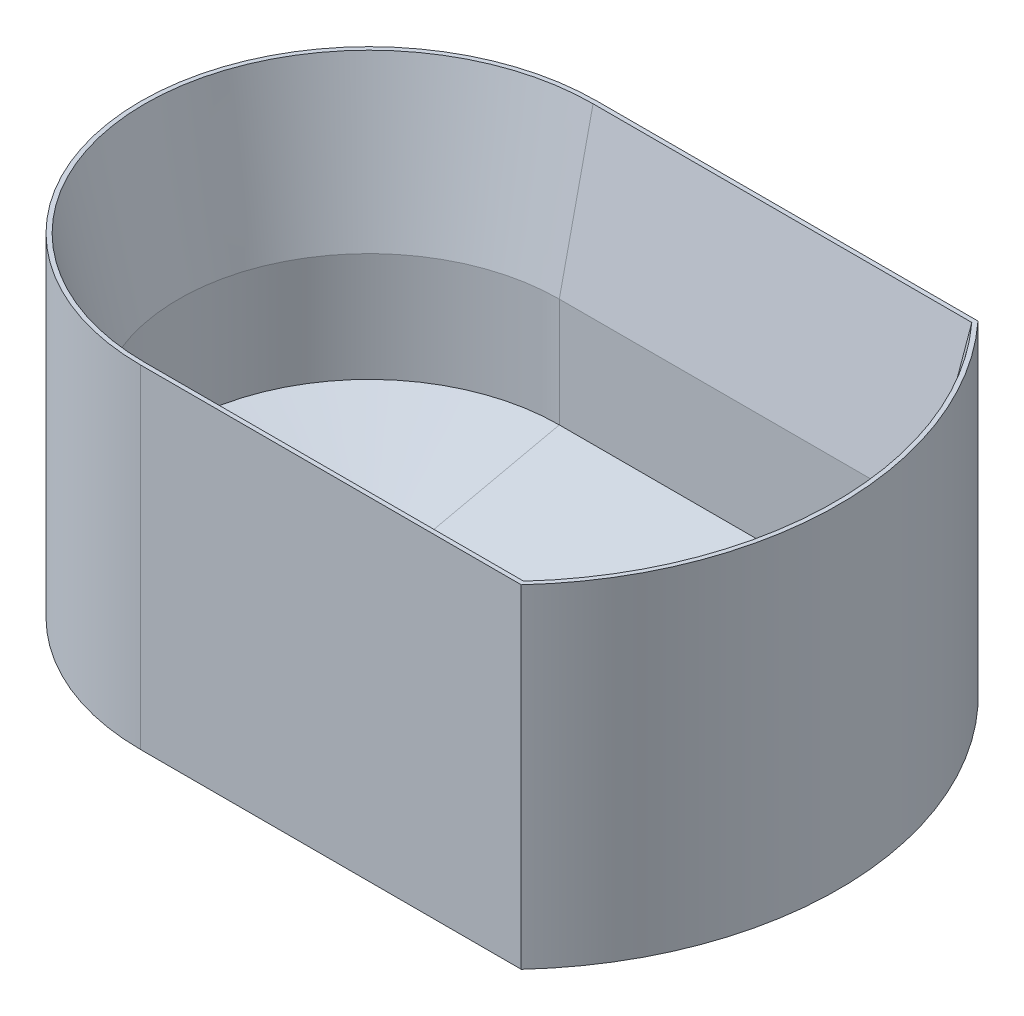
ISO-10303-21;
HEADER;
FILE_DESCRIPTION(('STEP AP214'),'2;1');
FILE_NAME('part.step','',(''),(''),'','','');
FILE_SCHEMA(('AUTOMOTIVE_DESIGN { 1 0 10303 214 1 1 1 1 }'));
ENDSEC;
DATA;
#1=APPLICATION_CONTEXT('core data for automotive mechanical design processes');
#2=APPLICATION_PROTOCOL_DEFINITION('international standard','automotive_design',2000,#1);
#3=PRODUCT_CONTEXT('',#1,'mechanical');
#4=PRODUCT('Part','Part','',(#3));
#5=PRODUCT_RELATED_PRODUCT_CATEGORY('part','',(#4));
#6=PRODUCT_DEFINITION_FORMATION('','',#4);
#7=PRODUCT_DEFINITION_CONTEXT('part definition',#1,'design');
#8=PRODUCT_DEFINITION('design','',#6,#7);
#9=PRODUCT_DEFINITION_SHAPE('','',#8);
#10=(LENGTH_UNIT() NAMED_UNIT(*) SI_UNIT(.MILLI.,.METRE.));
#11=(NAMED_UNIT(*) PLANE_ANGLE_UNIT() SI_UNIT($,.RADIAN.));
#12=(NAMED_UNIT(*) SI_UNIT($,.STERADIAN.) SOLID_ANGLE_UNIT());
#13=UNCERTAINTY_MEASURE_WITH_UNIT(LENGTH_MEASURE(1.E-05),#10,'distance_accuracy_value','');
#14=(GEOMETRIC_REPRESENTATION_CONTEXT(3) GLOBAL_UNCERTAINTY_ASSIGNED_CONTEXT((#13)) GLOBAL_UNIT_ASSIGNED_CONTEXT((#10,
#11,#12)) REPRESENTATION_CONTEXT('',''));
#15=CARTESIAN_POINT('',(0.,0.,0.));
#16=DIRECTION('',(0.,0.,1.));
#17=DIRECTION('',(1.,0.,0.));
#18=AXIS2_PLACEMENT_3D('',#15,#16,#17);
#19=CARTESIAN_POINT('',(0.,44.45,-30.48));
#20=DIRECTION('',(0.,-1.,0.));
#21=DIRECTION('',(0.,0.,-1.));
#22=AXIS2_PLACEMENT_3D('',#19,#20,#21);
#23=CYLINDRICAL_SURFACE('',#22,30.48);
#24=CARTESIAN_POINT('',(0.,0.,-30.48));
#25=DIRECTION('',(0.,1.,0.));
#26=DIRECTION('',(0.,0.,1.));
#27=AXIS2_PLACEMENT_3D('',#24,#25,#26);
#28=CIRCLE('',#27,30.48);
#29=CARTESIAN_POINT('',(0.,0.,-60.96));
#30=VERTEX_POINT('',#29);
#31=CARTESIAN_POINT('',(0.,0.,0.));
#32=VERTEX_POINT('',#31);
#33=EDGE_CURVE('E149',#30,#32,#28,.T.);
#34=ORIENTED_EDGE('',*,*,#33,.T.);
#35=DIRECTION('',(0.,-1.,0.));
#36=VECTOR('',#35,1.);
#37=CARTESIAN_POINT('',(0.,44.45,0.));
#38=LINE('',#37,#36);
#39=CARTESIAN_POINT('',(0.,44.45,0.));
#40=VERTEX_POINT('',#39);
#41=EDGE_CURVE('E131',#40,#32,#38,.T.);
#42=ORIENTED_EDGE('',*,*,#41,.F.);
#43=CARTESIAN_POINT('',(0.,44.45,-30.48));
#44=DIRECTION('',(0.,1.,0.));
#45=DIRECTION('',(0.,0.,1.));
#46=AXIS2_PLACEMENT_3D('',#43,#44,#45);
#47=CIRCLE('',#46,30.48);
#48=CARTESIAN_POINT('',(0.,44.45,-60.96));
#49=VERTEX_POINT('',#48);
#50=EDGE_CURVE('E138',#49,#40,#47,.T.);
#51=ORIENTED_EDGE('',*,*,#50,.F.);
#52=DIRECTION('',(0.,-1.,0.));
#53=VECTOR('',#52,1.);
#54=CARTESIAN_POINT('',(0.,44.45,-60.96));
#55=LINE('',#54,#53);
#56=EDGE_CURVE('E272',#49,#30,#55,.T.);
#57=ORIENTED_EDGE('',*,*,#56,.T.);
#58=EDGE_LOOP('',(#34,#42,#51,#57));
#59=FACE_BOUND('',#58,.T.);
#60=ADVANCED_FACE('F35',(#59),#23,.T.);
#61=CARTESIAN_POINT('',(0.,44.45,0.));
#62=DIRECTION('',(0.,0.,-1.));
#63=DIRECTION('',(-1.,0.,0.));
#64=AXIS2_PLACEMENT_3D('',#61,#62,#63);
#65=PLANE('',#64);
#66=DIRECTION('',(1.,0.,0.));
#67=VECTOR('',#66,1.);
#68=CARTESIAN_POINT('',(0.,0.,0.));
#69=LINE('',#68,#67);
#70=CARTESIAN_POINT('',(50.8,0.,0.));
#71=VERTEX_POINT('',#70);
#72=EDGE_CURVE('E274',#32,#71,#69,.T.);
#73=ORIENTED_EDGE('',*,*,#72,.T.);
#74=DIRECTION('',(0.,-1.,0.));
#75=VECTOR('',#74,1.);
#76=CARTESIAN_POINT('',(50.8,44.45,0.));
#77=LINE('',#76,#75);
#78=CARTESIAN_POINT('',(50.8,44.45,0.));
#79=VERTEX_POINT('',#78);
#80=EDGE_CURVE('E133',#79,#71,#77,.T.);
#81=ORIENTED_EDGE('',*,*,#80,.F.);
#82=DIRECTION('',(1.,0.,0.));
#83=VECTOR('',#82,1.);
#84=CARTESIAN_POINT('',(0.,44.45,0.));
#85=LINE('',#84,#83);
#86=EDGE_CURVE('E126',#40,#79,#85,.T.);
#87=ORIENTED_EDGE('',*,*,#86,.F.);
#88=ORIENTED_EDGE('',*,*,#41,.T.);
#89=EDGE_LOOP('',(#73,#81,#87,#88));
#90=FACE_BOUND('',#89,.T.);
#91=ADVANCED_FACE('F129',(#90),#65,.F.);
#92=CARTESIAN_POINT('',(17.8288823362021,44.45,-30.48));
#93=DIRECTION('',(0.,-1.,0.));
#94=DIRECTION('',(0.,0.,-1.));
#95=AXIS2_PLACEMENT_3D('',#92,#93,#94);
#96=CYLINDRICAL_SURFACE('',#95,44.9012806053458);
#97=CARTESIAN_POINT('',(17.8288823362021,0.,-30.48));
#98=DIRECTION('',(0.,1.,0.));
#99=DIRECTION('',(0.,0.,1.));
#100=AXIS2_PLACEMENT_3D('',#97,#98,#99);
#101=CIRCLE('',#100,44.9012806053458);
#102=CARTESIAN_POINT('',(50.8,0.,-60.96));
#103=VERTEX_POINT('',#102);
#104=EDGE_CURVE('E276',#103,#71,#101,.F.);
#105=ORIENTED_EDGE('',*,*,#104,.F.);
#106=DIRECTION('',(0.,-1.,0.));
#107=VECTOR('',#106,1.);
#108=CARTESIAN_POINT('',(50.8,44.45,-60.96));
#109=LINE('',#108,#107);
#110=CARTESIAN_POINT('',(50.8,44.45,-60.96));
#111=VERTEX_POINT('',#110);
#112=EDGE_CURVE('E154',#111,#103,#109,.T.);
#113=ORIENTED_EDGE('',*,*,#112,.F.);
#114=CARTESIAN_POINT('',(17.8288823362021,44.45,-30.48));
#115=DIRECTION('',(0.,1.,0.));
#116=DIRECTION('',(0.,0.,1.));
#117=AXIS2_PLACEMENT_3D('',#114,#115,#116);
#118=CIRCLE('',#117,44.9012806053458);
#119=EDGE_CURVE('E137',#111,#79,#118,.F.);
#120=ORIENTED_EDGE('',*,*,#119,.T.);
#121=ORIENTED_EDGE('',*,*,#80,.T.);
#122=EDGE_LOOP('',(#105,#113,#120,#121));
#123=FACE_BOUND('',#122,.T.);
#124=ADVANCED_FACE('F286',(#123),#96,.T.);
#125=CARTESIAN_POINT('',(0.,44.45,-60.96));
#126=DIRECTION('',(0.,0.,-1.));
#127=DIRECTION('',(-1.,0.,0.));
#128=AXIS2_PLACEMENT_3D('',#125,#126,#127);
#129=PLANE('',#128);
#130=DIRECTION('',(1.,0.,0.));
#131=VECTOR('',#130,1.);
#132=CARTESIAN_POINT('',(0.,0.,-60.96));
#133=LINE('',#132,#131);
#134=EDGE_CURVE('E146',#30,#103,#133,.T.);
#135=ORIENTED_EDGE('',*,*,#134,.F.);
#136=ORIENTED_EDGE('',*,*,#56,.F.);
#137=DIRECTION('',(1.,0.,0.));
#138=VECTOR('',#137,1.);
#139=CARTESIAN_POINT('',(0.,44.45,-60.96));
#140=LINE('',#139,#138);
#141=EDGE_CURVE('E144',#49,#111,#140,.T.);
#142=ORIENTED_EDGE('',*,*,#141,.T.);
#143=ORIENTED_EDGE('',*,*,#112,.T.);
#144=EDGE_LOOP('',(#135,#136,#142,#143));
#145=FACE_BOUND('',#144,.T.);
#146=ADVANCED_FACE('F284',(#145),#129,.T.);
#147=CARTESIAN_POINT('',(0.,44.45,0.));
#148=DIRECTION('',(0.,1.,0.));
#149=DIRECTION('',(0.,0.,1.));
#150=AXIS2_PLACEMENT_3D('',#147,#148,#149);
#151=PLANE('',#150);
#152=CARTESIAN_POINT('',(17.8288823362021,44.45,-30.48));
#153=DIRECTION('',(0.,1.,0.));
#154=DIRECTION('',(0.,0.,1.));
#155=AXIS2_PLACEMENT_3D('',#152,#153,#154);
#156=CIRCLE('',#155,44.3261161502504);
#157=CARTESIAN_POINT('',(50.5474609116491,44.45,-60.3848355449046));
#158=VERTEX_POINT('',#157);
#159=CARTESIAN_POINT('',(50.5474609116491,44.45,-0.575164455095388));
#160=VERTEX_POINT('',#159);
#161=EDGE_CURVE('E182',#158,#160,#156,.F.);
#162=ORIENTED_EDGE('',*,*,#161,.T.);
#163=DIRECTION('',(-1.,0.,0.));
#164=VECTOR('',#163,1.);
#165=CARTESIAN_POINT('',(0.,44.45,-0.575164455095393));
#166=LINE('',#165,#164);
#167=CARTESIAN_POINT('',(0.,44.45,-0.575164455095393));
#168=VERTEX_POINT('',#167);
#169=EDGE_CURVE('E11',#160,#168,#166,.T.);
#170=ORIENTED_EDGE('',*,*,#169,.T.);
#171=CARTESIAN_POINT('',(0.,44.45,-30.48));
#172=DIRECTION('',(0.,1.,0.));
#173=DIRECTION('',(0.,0.,1.));
#174=AXIS2_PLACEMENT_3D('',#171,#172,#173);
#175=CIRCLE('',#174,29.9048355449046);
#176=CARTESIAN_POINT('',(0.,44.45,-60.3848355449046));
#177=VERTEX_POINT('',#176);
#178=EDGE_CURVE('E44',#168,#177,#175,.F.);
#179=ORIENTED_EDGE('',*,*,#178,.T.);
#180=DIRECTION('',(1.,0.,0.));
#181=VECTOR('',#180,1.);
#182=CARTESIAN_POINT('',(48.4976675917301,44.45,-60.3848355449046));
#183=LINE('',#182,#181);
#184=EDGE_CURVE('E184',#177,#158,#183,.T.);
#185=ORIENTED_EDGE('',*,*,#184,.T.);
#186=EDGE_LOOP('',(#162,#170,#179,#185));
#187=FACE_BOUND('',#186,.T.);
#188=ORIENTED_EDGE('',*,*,#50,.T.);
#189=ORIENTED_EDGE('',*,*,#86,.T.);
#190=ORIENTED_EDGE('',*,*,#119,.F.);
#191=ORIENTED_EDGE('',*,*,#141,.F.);
#192=EDGE_LOOP('',(#188,#189,#190,#191));
#193=FACE_BOUND('',#192,.T.);
#194=ADVANCED_FACE('F142',(#187,#193),#151,.T.);
#195=CARTESIAN_POINT('',(0.,0.,0.));
#196=DIRECTION('',(0.,1.,0.));
#197=DIRECTION('',(0.,0.,1.));
#198=AXIS2_PLACEMENT_3D('',#195,#196,#197);
#199=PLANE('',#198);
#200=ORIENTED_EDGE('',*,*,#33,.F.);
#201=ORIENTED_EDGE('',*,*,#134,.T.);
#202=ORIENTED_EDGE('',*,*,#104,.T.);
#203=ORIENTED_EDGE('',*,*,#72,.F.);
#204=EDGE_LOOP('',(#200,#201,#202,#203));
#205=FACE_BOUND('',#204,.T.);
#206=ADVANCED_FACE('F288',(#205),#199,.F.);
#207=CARTESIAN_POINT('',(0.,44.45,-30.48));
#208=DIRECTION('',(0.,-1.,0.));
#209=DIRECTION('',(0.,0.,-1.));
#210=AXIS2_PLACEMENT_3D('',#207,#208,#209);
#211=CYLINDRICAL_SURFACE('',#210,25.4);
#212=DIRECTION('',(0.,1.,0.));
#213=VECTOR('',#212,1.);
#214=CARTESIAN_POINT('',(0.,44.45,-5.08));
#215=LINE('',#214,#213);
#216=CARTESIAN_POINT('',(0.,24.1299999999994,-5.08));
#217=VERTEX_POINT('',#216);
#218=CARTESIAN_POINT('',(0.,9.58483554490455,-5.08));
#219=VERTEX_POINT('',#218);
#220=EDGE_CURVE('E261',#217,#219,#215,.F.);
#221=ORIENTED_EDGE('',*,*,#220,.T.);
#222=CARTESIAN_POINT('',(0.,9.58483554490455,-30.48));
#223=DIRECTION('',(0.,1.,0.));
#224=DIRECTION('',(0.,0.,1.));
#225=AXIS2_PLACEMENT_3D('',#222,#223,#224);
#226=CIRCLE('',#225,25.4);
#227=CARTESIAN_POINT('',(0.,9.58483554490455,-55.88));
#228=VERTEX_POINT('',#227);
#229=EDGE_CURVE('E172',#219,#228,#226,.F.);
#230=ORIENTED_EDGE('',*,*,#229,.T.);
#231=DIRECTION('',(0.,-1.,0.));
#232=VECTOR('',#231,1.);
#233=CARTESIAN_POINT('',(0.,44.45,-55.88));
#234=LINE('',#233,#232);
#235=CARTESIAN_POINT('',(0.,24.1299999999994,-55.88));
#236=VERTEX_POINT('',#235);
#237=EDGE_CURVE('E218',#236,#228,#234,.T.);
#238=ORIENTED_EDGE('',*,*,#237,.F.);
#239=CARTESIAN_POINT('',(0.,24.1299999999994,-30.48));
#240=DIRECTION('',(0.,1.,0.));
#241=DIRECTION('',(0.,0.,1.));
#242=AXIS2_PLACEMENT_3D('',#239,#240,#241);
#243=CIRCLE('',#242,25.4);
#244=EDGE_CURVE('E170',#236,#217,#243,.T.);
#245=ORIENTED_EDGE('',*,*,#244,.T.);
#246=EDGE_LOOP('',(#221,#230,#238,#245));
#247=FACE_BOUND('',#246,.T.);
#248=ADVANCED_FACE('F290',(#247),#211,.F.);
#249=CARTESIAN_POINT('',(0.,44.45,-5.08));
#250=DIRECTION('',(0.,0.,-1.));
#251=DIRECTION('',(-1.,0.,0.));
#252=AXIS2_PLACEMENT_3D('',#249,#250,#251);
#253=PLANE('',#252);
#254=DIRECTION('',(0.,-1.,0.));
#255=VECTOR('',#254,1.);
#256=CARTESIAN_POINT('',(48.4976675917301,44.45,-5.08));
#257=LINE('',#256,#255);
#258=CARTESIAN_POINT('',(48.4976675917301,24.1299999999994,-5.08));
#259=VERTEX_POINT('',#258);
#260=CARTESIAN_POINT('',(48.4976675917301,9.58483554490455,-5.08));
#261=VERTEX_POINT('',#260);
#262=EDGE_CURVE('E258',#259,#261,#257,.T.);
#263=ORIENTED_EDGE('',*,*,#262,.T.);
#264=DIRECTION('',(-1.,0.,0.));
#265=VECTOR('',#264,1.);
#266=CARTESIAN_POINT('',(0.,9.58483554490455,-5.08));
#267=LINE('',#266,#265);
#268=EDGE_CURVE('E167',#261,#219,#267,.T.);
#269=ORIENTED_EDGE('',*,*,#268,.T.);
#270=ORIENTED_EDGE('',*,*,#220,.F.);
#271=DIRECTION('',(1.,0.,0.));
#272=VECTOR('',#271,1.);
#273=CARTESIAN_POINT('',(0.,24.1299999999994,-5.08));
#274=LINE('',#273,#272);
#275=EDGE_CURVE('E164',#217,#259,#274,.T.);
#276=ORIENTED_EDGE('',*,*,#275,.T.);
#277=EDGE_LOOP('',(#263,#269,#270,#276));
#278=FACE_BOUND('',#277,.T.);
#279=ADVANCED_FACE('F257',(#278),#253,.T.);
#280=CARTESIAN_POINT('',(17.8288823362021,44.45,-30.48));
#281=DIRECTION('',(0.,-1.,0.));
#282=DIRECTION('',(0.,0.,-1.));
#283=AXIS2_PLACEMENT_3D('',#280,#281,#282);
#284=CYLINDRICAL_SURFACE('',#283,39.8212806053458);
#285=DIRECTION('',(0.,-1.,0.));
#286=VECTOR('',#285,1.);
#287=CARTESIAN_POINT('',(48.4976675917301,44.45,-55.88));
#288=LINE('',#287,#286);
#289=CARTESIAN_POINT('',(48.4976675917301,24.1299999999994,-55.88));
#290=VERTEX_POINT('',#289);
#291=CARTESIAN_POINT('',(48.4976675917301,9.58483554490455,-55.88));
#292=VERTEX_POINT('',#291);
#293=EDGE_CURVE('E264',#290,#292,#288,.T.);
#294=ORIENTED_EDGE('',*,*,#293,.T.);
#295=CARTESIAN_POINT('',(17.8288823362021,9.58483554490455,-30.48));
#296=DIRECTION('',(0.,1.,0.));
#297=DIRECTION('',(0.,0.,1.));
#298=AXIS2_PLACEMENT_3D('',#295,#296,#297);
#299=CIRCLE('',#298,39.8212806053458);
#300=EDGE_CURVE('E176',#292,#261,#299,.F.);
#301=ORIENTED_EDGE('',*,*,#300,.T.);
#302=ORIENTED_EDGE('',*,*,#262,.F.);
#303=CARTESIAN_POINT('',(17.8288823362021,24.1299999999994,-30.48));
#304=DIRECTION('',(0.,1.,0.));
#305=DIRECTION('',(0.,0.,1.));
#306=AXIS2_PLACEMENT_3D('',#303,#304,#305);
#307=CIRCLE('',#306,39.8212806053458);
#308=EDGE_CURVE('E174',#259,#290,#307,.T.);
#309=ORIENTED_EDGE('',*,*,#308,.T.);
#310=EDGE_LOOP('',(#294,#301,#302,#309));
#311=FACE_BOUND('',#310,.T.);
#312=ADVANCED_FACE('F262',(#311),#284,.F.);
#313=CARTESIAN_POINT('',(0.,44.45,-55.88));
#314=DIRECTION('',(0.,0.,-1.));
#315=DIRECTION('',(-1.,0.,0.));
#316=AXIS2_PLACEMENT_3D('',#313,#314,#315);
#317=PLANE('',#316);
#318=ORIENTED_EDGE('',*,*,#237,.T.);
#319=DIRECTION('',(1.,0.,0.));
#320=VECTOR('',#319,1.);
#321=CARTESIAN_POINT('',(0.,9.58483554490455,-55.88));
#322=LINE('',#321,#320);
#323=EDGE_CURVE('E180',#228,#292,#322,.T.);
#324=ORIENTED_EDGE('',*,*,#323,.T.);
#325=ORIENTED_EDGE('',*,*,#293,.F.);
#326=DIRECTION('',(-1.,0.,0.));
#327=VECTOR('',#326,1.);
#328=CARTESIAN_POINT('',(0.,24.1299999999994,-55.88));
#329=LINE('',#328,#327);
#330=EDGE_CURVE('E178',#290,#236,#329,.T.);
#331=ORIENTED_EDGE('',*,*,#330,.T.);
#332=EDGE_LOOP('',(#318,#324,#325,#331));
#333=FACE_BOUND('',#332,.T.);
#334=ADVANCED_FACE('F343',(#333),#317,.F.);
#335=CARTESIAN_POINT('',(0.,5.08,0.));
#336=DIRECTION('',(0.,1.,0.));
#337=DIRECTION('',(0.,0.,1.));
#338=AXIS2_PLACEMENT_3D('',#335,#336,#337);
#339=PLANE('',#338);
#340=CARTESIAN_POINT('',(0.,5.08,-30.48));
#341=DIRECTION('',(0.,1.,0.));
#342=DIRECTION('',(0.,0.,1.));
#343=AXIS2_PLACEMENT_3D('',#340,#341,#342);
#344=CIRCLE('',#343,5.08000000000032);
#345=CARTESIAN_POINT('',(0.,5.08,-35.5600000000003));
#346=VERTEX_POINT('',#345);
#347=CARTESIAN_POINT('',(0.,5.08,-25.3999999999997));
#348=VERTEX_POINT('',#347);
#349=EDGE_CURVE('E159',#346,#348,#344,.T.);
#350=ORIENTED_EDGE('',*,*,#349,.T.);
#351=DIRECTION('',(1.,0.,0.));
#352=VECTOR('',#351,1.);
#353=CARTESIAN_POINT('',(48.4976675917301,5.08,-25.3999999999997));
#354=LINE('',#353,#352);
#355=CARTESIAN_POINT('',(36.6568813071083,5.08,-25.3999999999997));
#356=VERTEX_POINT('',#355);
#357=EDGE_CURVE('E161',#348,#356,#354,.T.);
#358=ORIENTED_EDGE('',*,*,#357,.T.);
#359=CARTESIAN_POINT('',(17.8288823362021,5.08,-30.48));
#360=DIRECTION('',(0.,1.,0.));
#361=DIRECTION('',(0.,0.,1.));
#362=AXIS2_PLACEMENT_3D('',#359,#360,#361);
#363=CIRCLE('',#362,19.5012806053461);
#364=CARTESIAN_POINT('',(36.6568813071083,5.08,-35.5600000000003));
#365=VERTEX_POINT('',#364);
#366=EDGE_CURVE('E152',#356,#365,#363,.T.);
#367=ORIENTED_EDGE('',*,*,#366,.T.);
#368=DIRECTION('',(-1.,0.,0.));
#369=VECTOR('',#368,1.);
#370=CARTESIAN_POINT('',(0.,5.08,-35.5600000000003));
#371=LINE('',#370,#369);
#372=EDGE_CURVE('E150',#365,#346,#371,.T.);
#373=ORIENTED_EDGE('',*,*,#372,.T.);
#374=EDGE_LOOP('',(#350,#358,#367,#373));
#375=FACE_BOUND('',#374,.T.);
#376=ADVANCED_FACE('F352',(#375),#339,.T.);
#377=CARTESIAN_POINT('',(0.,9.58483554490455,-55.88));
#378=DIRECTION('',(0.,-0.976296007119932,-0.216439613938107));
#379=DIRECTION('',(1.,0.,0.));
#380=AXIS2_PLACEMENT_3D('',#377,#378,#379);
#381=PLANE('',#380);
#382=CARTESIAN_POINT('',(36.6568813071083,5.08,-35.5600000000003));
#383=CARTESIAN_POINT('',(37.1542379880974,5.22400663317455,-36.2095719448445));
#384=CARTESIAN_POINT('',(37.6391024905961,5.36999719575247,-36.8680928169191));
#385=CARTESIAN_POINT('',(38.5862681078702,5.6653133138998,-38.2001777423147));
#386=CARTESIAN_POINT('',(39.0485754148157,5.81463793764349,-38.8737375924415));
#387=CARTESIAN_POINT('',(39.9528832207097,6.11592415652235,-40.2327519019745));
#388=CARTESIAN_POINT('',(40.3949028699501,6.26788307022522,-40.9181942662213));
#389=CARTESIAN_POINT('',(41.2611781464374,6.57416479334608,-42.2997418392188));
#390=CARTESIAN_POINT('',(41.6854323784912,6.72848778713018,-42.9958478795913));
#391=CARTESIAN_POINT('',(42.9313298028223,7.19336467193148,-45.0927719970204));
#392=CARTESIAN_POINT('',(43.7292810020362,7.50689803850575,-46.5070296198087));
#393=CARTESIAN_POINT('',(45.2731382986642,8.13993424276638,-49.3624714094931));
#394=CARTESIAN_POINT('',(46.0190351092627,8.45943813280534,-50.8036603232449));
#395=CARTESIAN_POINT('',(47.0425286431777,8.91437919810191,-52.8557668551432));
#396=CARTESIAN_POINT('',(47.338309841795,9.04791555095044,-53.458110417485));
#397=CARTESIAN_POINT('',(47.9230474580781,9.31580365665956,-54.6664755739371));
#398=CARTESIAN_POINT('',(48.2119988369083,9.45015592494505,-55.2724994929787));
#399=CARTESIAN_POINT('',(48.4976675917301,9.58483554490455,-55.88));
#400=B_SPLINE_CURVE_WITH_KNOTS('',3,(#382,#383,#384,#385,#386,#387,#388,#389,#390,#391,#392,
#393,#394,#395,#396,#397,#398,#399),.UNSPECIFIED.,.F.,.F.,(4,2,2,2,2,2,2,2,4),(0.,
2.49172405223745,4.9827602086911,7.47139447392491,9.96022381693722,14.9202581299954,
19.8811750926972,21.9337560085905,23.9878067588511),.UNSPECIFIED.);
#401=EDGE_CURVE('E209',#292,#365,#400,.F.);
#402=ORIENTED_EDGE('',*,*,#401,.F.);
#403=ORIENTED_EDGE('',*,*,#323,.F.);
#404=DIRECTION('',(0.,0.216439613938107,-0.976296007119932));
#405=VECTOR('',#404,1.);
#406=CARTESIAN_POINT('',(0.,5.08,-35.5600000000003));
#407=LINE('',#406,#405);
#408=EDGE_CURVE('E215',#346,#228,#407,.T.);
#409=ORIENTED_EDGE('',*,*,#408,.F.);
#410=ORIENTED_EDGE('',*,*,#372,.F.);
#411=EDGE_LOOP('',(#402,#403,#409,#410));
#412=FACE_BOUND('',#411,.T.);
#413=ADVANCED_FACE('F205',(#412),#381,.F.);
#414=CARTESIAN_POINT('',(0.,5.08,-30.48));
#415=DIRECTION('',(0.,1.,0.));
#416=DIRECTION('',(0.,0.,1.));
#417=AXIS2_PLACEMENT_3D('',#414,#415,#416);
#418=CONICAL_SURFACE('',#417,5.08000000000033,1.3526301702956);
#419=ORIENTED_EDGE('',*,*,#408,.T.);
#420=ORIENTED_EDGE('',*,*,#229,.F.);
#421=DIRECTION('',(0.,0.216439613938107,0.976296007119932));
#422=VECTOR('',#421,1.);
#423=CARTESIAN_POINT('',(0.,5.08,-25.3999999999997));
#424=LINE('',#423,#422);
#425=EDGE_CURVE('E194',#348,#219,#424,.T.);
#426=ORIENTED_EDGE('',*,*,#425,.F.);
#427=ORIENTED_EDGE('',*,*,#349,.F.);
#428=EDGE_LOOP('',(#419,#420,#426,#427));
#429=FACE_BOUND('',#428,.T.);
#430=ADVANCED_FACE('F203',(#429),#418,.F.);
#431=CARTESIAN_POINT('',(17.8288823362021,9.58483554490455,-30.48));
#432=DIRECTION('',(0.,1.,0.));
#433=DIRECTION('',(0.,0.,1.));
#434=AXIS2_PLACEMENT_3D('',#431,#432,#433);
#435=CONICAL_SURFACE('',#434,39.8212806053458,1.3526301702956);
#436=ORIENTED_EDGE('',*,*,#401,.T.);
#437=ORIENTED_EDGE('',*,*,#366,.F.);
#438=CARTESIAN_POINT('',(36.6568813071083,5.08,-25.3999999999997));
#439=CARTESIAN_POINT('',(37.1542379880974,5.22400663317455,-24.7504280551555));
#440=CARTESIAN_POINT('',(37.6391024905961,5.36999719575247,-24.0919071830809));
#441=CARTESIAN_POINT('',(38.5862681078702,5.6653133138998,-22.7598222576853));
#442=CARTESIAN_POINT('',(39.0485754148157,5.81463793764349,-22.0862624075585));
#443=CARTESIAN_POINT('',(39.9528832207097,6.11592415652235,-20.7272480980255));
#444=CARTESIAN_POINT('',(40.3949028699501,6.26788307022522,-20.0418057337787));
#445=CARTESIAN_POINT('',(41.2611781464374,6.57416479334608,-18.6602581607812));
#446=CARTESIAN_POINT('',(41.6854323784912,6.72848778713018,-17.9641521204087));
#447=CARTESIAN_POINT('',(42.9313298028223,7.19336467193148,-15.8672280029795));
#448=CARTESIAN_POINT('',(43.7292810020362,7.50689803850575,-14.4529703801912));
#449=CARTESIAN_POINT('',(45.2731382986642,8.13993424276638,-11.5975285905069));
#450=CARTESIAN_POINT('',(46.0190351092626,8.45943813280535,-10.1563396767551));
#451=CARTESIAN_POINT('',(47.0425286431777,8.91437919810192,-8.10423314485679));
#452=CARTESIAN_POINT('',(47.338309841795,9.04791555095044,-7.50188958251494));
#453=CARTESIAN_POINT('',(47.9230474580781,9.31580365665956,-6.2935244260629));
#454=CARTESIAN_POINT('',(48.2119988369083,9.45015592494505,-5.68750050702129));
#455=CARTESIAN_POINT('',(48.4976675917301,9.58483554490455,-5.08));
#456=B_SPLINE_CURVE_WITH_KNOTS('',3,(#438,#439,#440,#441,#442,#443,#444,#445,#446,#447,#448,
#449,#450,#451,#452,#453,#454,#455),.UNSPECIFIED.,.F.,.F.,(4,2,2,2,2,2,2,2,4),(0.,
2.49172405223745,4.9827602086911,7.47139447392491,9.96022381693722,14.9202581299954,
19.8811750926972,21.9337560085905,23.9878067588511),.UNSPECIFIED.);
#457=EDGE_CURVE('E187',#261,#356,#456,.F.);
#458=ORIENTED_EDGE('',*,*,#457,.F.);
#459=ORIENTED_EDGE('',*,*,#300,.F.);
#460=EDGE_LOOP('',(#436,#437,#458,#459));
#461=FACE_BOUND('',#460,.T.);
#462=ADVANCED_FACE('F199',(#461),#435,.F.);
#463=CARTESIAN_POINT('',(0.,5.08,-25.3999999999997));
#464=DIRECTION('',(0.,0.976296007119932,-0.216439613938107));
#465=DIRECTION('',(-1.,0.,0.));
#466=AXIS2_PLACEMENT_3D('',#463,#464,#465);
#467=PLANE('',#466);
#468=ORIENTED_EDGE('',*,*,#425,.T.);
#469=ORIENTED_EDGE('',*,*,#268,.F.);
#470=ORIENTED_EDGE('',*,*,#457,.T.);
#471=ORIENTED_EDGE('',*,*,#357,.F.);
#472=EDGE_LOOP('',(#468,#469,#470,#471));
#473=FACE_BOUND('',#472,.T.);
#474=ADVANCED_FACE('F196',(#473),#467,.T.);
#475=CARTESIAN_POINT('',(0.,44.45,-60.3848355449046));
#476=DIRECTION('',(0.,0.2164396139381,0.976296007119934));
#477=DIRECTION('',(-1.,0.,0.));
#478=AXIS2_PLACEMENT_3D('',#475,#476,#477);
#479=PLANE('',#478);
#480=CARTESIAN_POINT('',(50.5474609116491,44.45,-60.3848355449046));
#481=CARTESIAN_POINT('',(50.3819445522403,42.7561605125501,-60.0093203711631));
#482=CARTESIAN_POINT('',(50.2151865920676,41.0624364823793,-59.6338307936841));
#483=CARTESIAN_POINT('',(49.8790647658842,37.6752391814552,-58.8829072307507));
#484=CARTESIAN_POINT('',(49.7097009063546,35.981765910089,-58.5074732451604));
#485=CARTESIAN_POINT('',(49.3682436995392,32.5950809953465,-57.7566632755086));
#486=CARTESIAN_POINT('',(49.1961503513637,30.9018693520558,-57.3812872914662));
#487=CARTESIAN_POINT('',(48.8490950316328,27.5157220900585,-56.6305965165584));
#488=CARTESIAN_POINT('',(48.6741330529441,25.8227864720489,-56.2552817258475));
#489=CARTESIAN_POINT('',(48.4976675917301,24.1299999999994,-55.88));
#490=B_SPLINE_CURVE_WITH_KNOTS('',3,(#480,#481,#482,#483,#484,#485,#486,#487,#488,#489),
.UNSPECIFIED.,.F.,.F.,(4,2,2,2,4),(0.,5.22852692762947,10.4570408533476,15.6855564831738,
20.9140851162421),.UNSPECIFIED.);
#491=EDGE_CURVE('E235',#158,#290,#490,.T.);
#492=ORIENTED_EDGE('',*,*,#491,.F.);
#493=ORIENTED_EDGE('',*,*,#184,.F.);
#494=DIRECTION('',(0.,0.976296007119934,-0.2164396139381));
#495=VECTOR('',#494,1.);
#496=CARTESIAN_POINT('',(0.,24.1299999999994,-55.88));
#497=LINE('',#496,#495);
#498=EDGE_CURVE('E39',#236,#177,#497,.T.);
#499=ORIENTED_EDGE('',*,*,#498,.F.);
#500=ORIENTED_EDGE('',*,*,#330,.F.);
#501=EDGE_LOOP('',(#492,#493,#499,#500));
#502=FACE_BOUND('',#501,.T.);
#503=ADVANCED_FACE('F232',(#502),#479,.T.);
#504=CARTESIAN_POINT('',(0.,24.1299999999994,-30.48));
#505=DIRECTION('',(0.,1.,0.));
#506=DIRECTION('',(0.,0.,1.));
#507=AXIS2_PLACEMENT_3D('',#504,#505,#506);
#508=CONICAL_SURFACE('',#507,25.4,0.218166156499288);
#509=ORIENTED_EDGE('',*,*,#498,.T.);
#510=ORIENTED_EDGE('',*,*,#178,.F.);
#511=DIRECTION('',(0.,0.976296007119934,0.2164396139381));
#512=VECTOR('',#511,1.);
#513=CARTESIAN_POINT('',(0.,24.1299999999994,-5.08));
#514=LINE('',#513,#512);
#515=EDGE_CURVE('E52',#217,#168,#514,.T.);
#516=ORIENTED_EDGE('',*,*,#515,.F.);
#517=ORIENTED_EDGE('',*,*,#244,.F.);
#518=EDGE_LOOP('',(#509,#510,#516,#517));
#519=FACE_BOUND('',#518,.T.);
#520=ADVANCED_FACE('F37',(#519),#508,.F.);
#521=CARTESIAN_POINT('',(17.8288823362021,44.45,-30.48));
#522=DIRECTION('',(0.,1.,0.));
#523=DIRECTION('',(0.,0.,1.));
#524=AXIS2_PLACEMENT_3D('',#521,#522,#523);
#525=CONICAL_SURFACE('',#524,44.3261161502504,0.218166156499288);
#526=ORIENTED_EDGE('',*,*,#491,.T.);
#527=ORIENTED_EDGE('',*,*,#308,.F.);
#528=CARTESIAN_POINT('',(48.4976675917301,24.1299999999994,-5.08));
#529=CARTESIAN_POINT('',(48.6741330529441,25.8227864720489,-4.70471827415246));
#530=CARTESIAN_POINT('',(48.8490950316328,27.5157220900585,-4.32940348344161));
#531=CARTESIAN_POINT('',(49.1961503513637,30.9018693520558,-3.57871270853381));
#532=CARTESIAN_POINT('',(49.3682436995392,32.5950809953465,-3.20333672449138));
#533=CARTESIAN_POINT('',(49.7097009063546,35.981765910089,-2.45252675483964));
#534=CARTESIAN_POINT('',(49.8790647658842,37.6752391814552,-2.07709276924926));
#535=CARTESIAN_POINT('',(50.2151865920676,41.0624364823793,-1.32616920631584));
#536=CARTESIAN_POINT('',(50.3819445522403,42.7561605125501,-0.950679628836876));
#537=CARTESIAN_POINT('',(50.5474609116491,44.45,-0.575164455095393));
#538=B_SPLINE_CURVE_WITH_KNOTS('',3,(#528,#529,#530,#531,#532,#533,#534,#535,#536,#537),
.UNSPECIFIED.,.F.,.F.,(4,2,2,2,4),(0.,5.22852863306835,10.4570442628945,15.6855581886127,
20.9140851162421),.UNSPECIFIED.);
#539=EDGE_CURVE('E219',#160,#259,#538,.F.);
#540=ORIENTED_EDGE('',*,*,#539,.F.);
#541=ORIENTED_EDGE('',*,*,#161,.F.);
#542=EDGE_LOOP('',(#526,#527,#540,#541));
#543=FACE_BOUND('',#542,.T.);
#544=ADVANCED_FACE('F228',(#543),#525,.F.);
#545=CARTESIAN_POINT('',(0.,24.1299999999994,-5.08));
#546=DIRECTION('',(0.,-0.2164396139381,0.976296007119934));
#547=DIRECTION('',(1.,0.,0.));
#548=AXIS2_PLACEMENT_3D('',#545,#546,#547);
#549=PLANE('',#548);
#550=ORIENTED_EDGE('',*,*,#515,.T.);
#551=ORIENTED_EDGE('',*,*,#169,.F.);
#552=ORIENTED_EDGE('',*,*,#539,.T.);
#553=ORIENTED_EDGE('',*,*,#275,.F.);
#554=EDGE_LOOP('',(#550,#551,#552,#553));
#555=FACE_BOUND('',#554,.T.);
#556=ADVANCED_FACE('F226',(#555),#549,.F.);
#557=CLOSED_SHELL('',(#60,#91,#124,#146,#194,#206,#248,#279,#312,#334,#376,#413,#430,#462,#474,
#503,#520,#544,#556));
#558=MANIFOLD_SOLID_BREP('B2',#557);
#559=ADVANCED_BREP_SHAPE_REPRESENTATION('',(#18,#558),#14);
#560=SHAPE_DEFINITION_REPRESENTATION(#9,#559);
ENDSEC;
END-ISO-10303-21;
